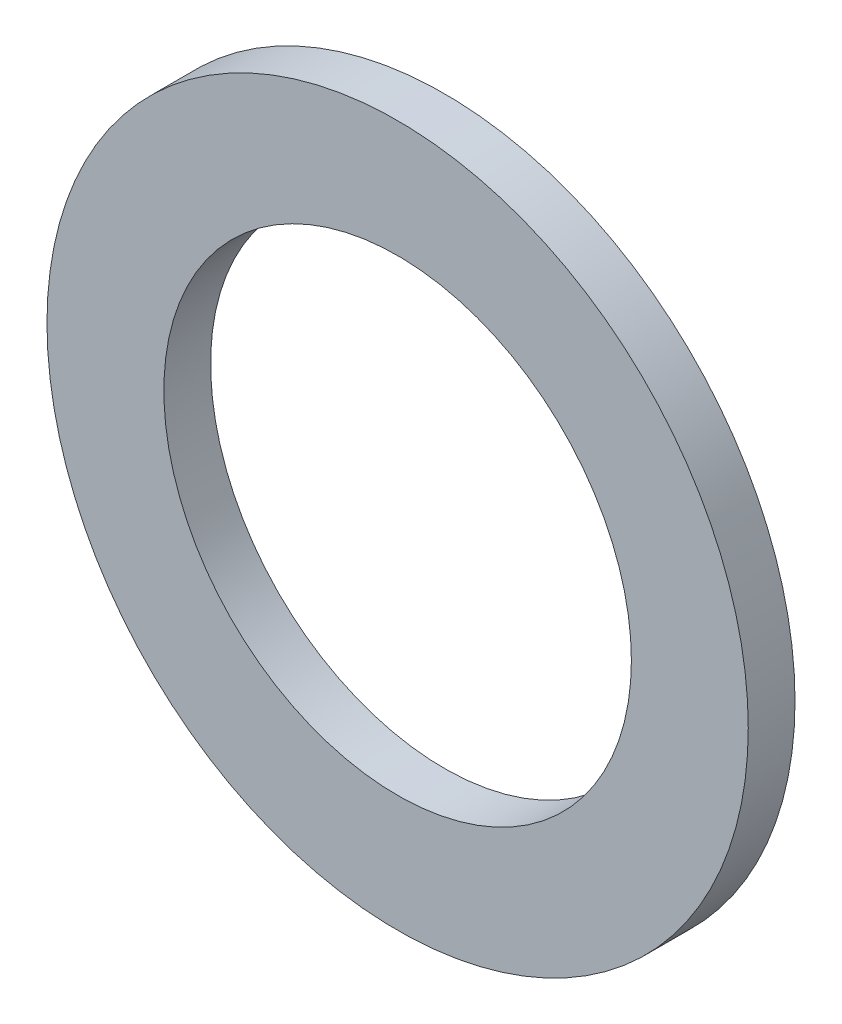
from build123d import *

# Parameters (mm, degrees)
SKETCH_1_R      = 15
SKETCH_1_R_2    = 10
EXTRUDE_1_DEPTH = 2


with BuildPart() as part:
    # Sketch 1 → Extrude 1 (new body)
    with BuildSketch(Plane.XY):
        Circle(SKETCH_1_R)
        Circle(SKETCH_1_R_2, mode=Mode.SUBTRACT)
    extrude(amount=EXTRUDE_1_DEPTH)


solid = part.part
